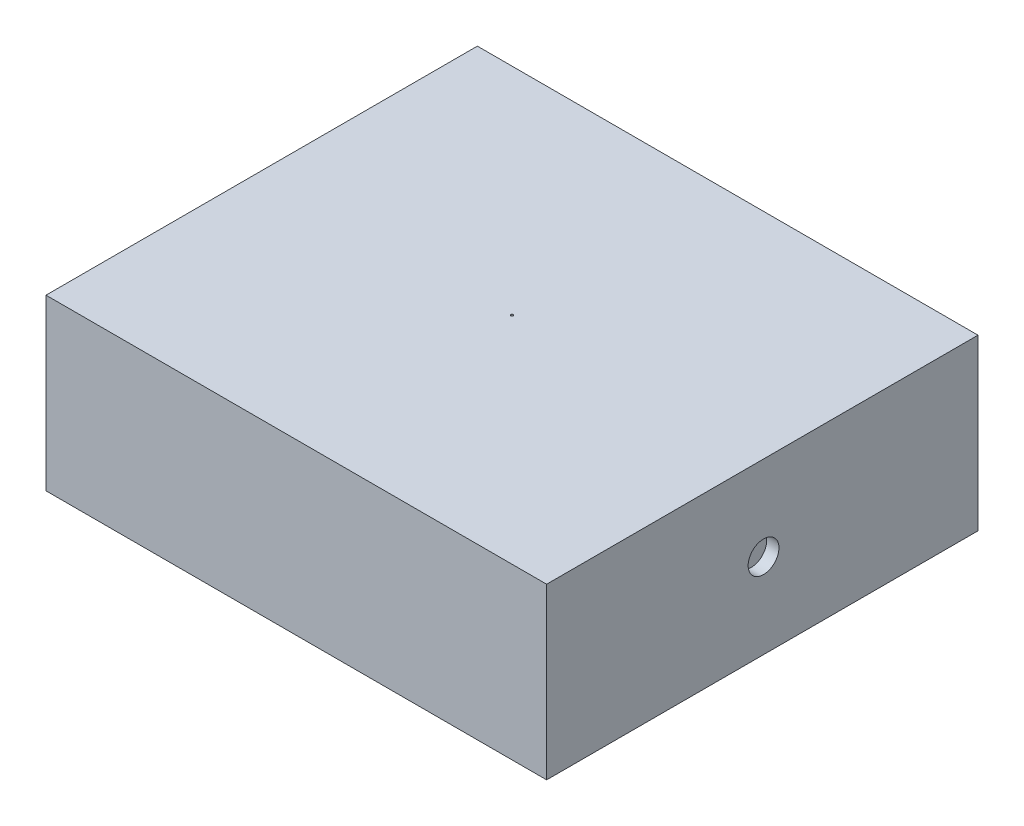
from build123d import *

# Parameters (mm, degrees)
SKETCH1_W           = 103.1748
SKETCH1_H           = 88.9
BOSS_EXTRUDE1_DEPTH = 34.925
SKETCH3_R           = 0.254
CUT_EXTRUDE1_DEPTH  = 77.529850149
SKETCH6_R           = 3.175
CUT_EXTRUDE2_DEPTH  = 2.54


with BuildPart() as part:
    # Sketch1 → Boss-Extrude1 (new body)
    with BuildSketch(Plane(origin=(0, 0, 0), x_dir=(1, 0, 0), z_dir=(0, 1, 0))):
        Rectangle(SKETCH1_W, SKETCH1_H)
    extrude(amount=-BOSS_EXTRUDE1_DEPTH)

    # Sketch3 → Cut-Extrude1 (cut, through all)
    with BuildSketch(Plane(origin=(0, 0, 0), x_dir=(1, 0, 0), z_dir=(0, 1, 0))):
        with Locations(Location((0, 0, 0), (0, 0, 270))):
            Circle(SKETCH3_R)
    extrude(amount=-CUT_EXTRUDE1_DEPTH, mode=Mode.SUBTRACT)

    # Sketch6 → Cut-Extrude2 (cut)
    with BuildSketch(Plane(origin=(51.5874, 0, 0), x_dir=(0, 0, -1), z_dir=(1, 0, 0))):
        with Locations((0.254, -17.4498)):
            Circle(SKETCH6_R)
    extrude(amount=-CUT_EXTRUDE2_DEPTH, mode=Mode.SUBTRACT)


solid = part.part
